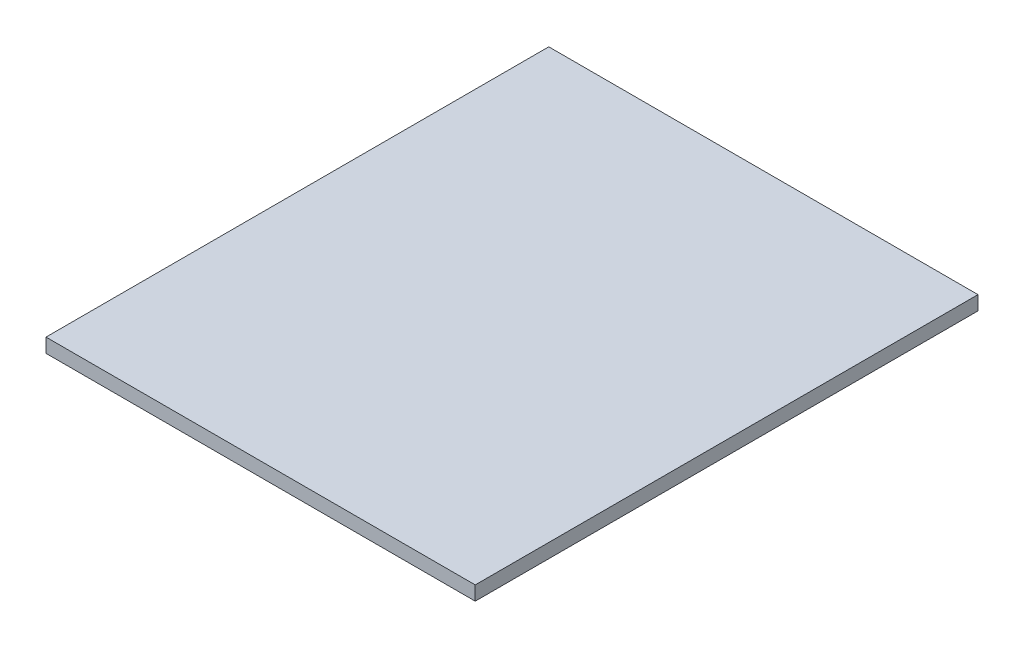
ISO-10303-21;
HEADER;
FILE_DESCRIPTION(('STEP AP214'),'2;1');
FILE_NAME('part.step','',(''),(''),'','','');
FILE_SCHEMA(('AUTOMOTIVE_DESIGN { 1 0 10303 214 1 1 1 1 }'));
ENDSEC;
DATA;
#1=APPLICATION_CONTEXT('core data for automotive mechanical design processes');
#2=APPLICATION_PROTOCOL_DEFINITION('international standard','automotive_design',2000,#1);
#3=PRODUCT_CONTEXT('',#1,'mechanical');
#4=PRODUCT('Part','Part','',(#3));
#5=PRODUCT_RELATED_PRODUCT_CATEGORY('part','',(#4));
#6=PRODUCT_DEFINITION_FORMATION('','',#4);
#7=PRODUCT_DEFINITION_CONTEXT('part definition',#1,'design');
#8=PRODUCT_DEFINITION('design','',#6,#7);
#9=PRODUCT_DEFINITION_SHAPE('','',#8);
#10=(LENGTH_UNIT() NAMED_UNIT(*) SI_UNIT(.MILLI.,.METRE.));
#11=(NAMED_UNIT(*) PLANE_ANGLE_UNIT() SI_UNIT($,.RADIAN.));
#12=(NAMED_UNIT(*) SI_UNIT($,.STERADIAN.) SOLID_ANGLE_UNIT());
#13=UNCERTAINTY_MEASURE_WITH_UNIT(LENGTH_MEASURE(1.E-05),#10,'distance_accuracy_value','');
#14=(GEOMETRIC_REPRESENTATION_CONTEXT(3) GLOBAL_UNCERTAINTY_ASSIGNED_CONTEXT((#13)) GLOBAL_UNIT_ASSIGNED_CONTEXT((#10,
#11,#12)) REPRESENTATION_CONTEXT('',''));
#15=CARTESIAN_POINT('',(0.,0.,0.));
#16=DIRECTION('',(0.,0.,1.));
#17=DIRECTION('',(1.,0.,0.));
#18=AXIS2_PLACEMENT_3D('',#15,#16,#17);
#19=CARTESIAN_POINT('',(9.4933098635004,2.5,-60.));
#20=DIRECTION('',(-1.,0.,0.));
#21=DIRECTION('',(0.,0.,1.));
#22=AXIS2_PLACEMENT_3D('',#19,#20,#21);
#23=PLANE('',#22);
#24=DIRECTION('',(0.,0.,-1.));
#25=VECTOR('',#24,1.);
#26=CARTESIAN_POINT('',(9.4933098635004,0.,-60.));
#27=LINE('',#26,#25);
#28=CARTESIAN_POINT('',(9.49330986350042,0.,29.02));
#29=VERTEX_POINT('',#28);
#30=CARTESIAN_POINT('',(9.4933098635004,0.,-60.));
#31=VERTEX_POINT('',#30);
#32=EDGE_CURVE('E98',#29,#31,#27,.T.);
#33=ORIENTED_EDGE('',*,*,#32,.T.);
#34=DIRECTION('',(0.,-1.,0.));
#35=VECTOR('',#34,1.);
#36=CARTESIAN_POINT('',(9.4933098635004,2.5,-60.));
#37=LINE('',#36,#35);
#38=CARTESIAN_POINT('',(9.4933098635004,2.5,-60.));
#39=VERTEX_POINT('',#38);
#40=EDGE_CURVE('E11',#39,#31,#37,.T.);
#41=ORIENTED_EDGE('',*,*,#40,.F.);
#42=DIRECTION('',(0.,0.,-1.));
#43=VECTOR('',#42,1.);
#44=CARTESIAN_POINT('',(9.4933098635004,2.5,-60.));
#45=LINE('',#44,#43);
#46=CARTESIAN_POINT('',(9.49330986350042,2.5,29.02));
#47=VERTEX_POINT('',#46);
#48=EDGE_CURVE('E86',#47,#39,#45,.T.);
#49=ORIENTED_EDGE('',*,*,#48,.F.);
#50=DIRECTION('',(0.,-1.,0.));
#51=VECTOR('',#50,1.);
#52=CARTESIAN_POINT('',(9.49330986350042,2.5,29.02));
#53=LINE('',#52,#51);
#54=EDGE_CURVE('E94',#47,#29,#53,.T.);
#55=ORIENTED_EDGE('',*,*,#54,.T.);
#56=EDGE_LOOP('',(#33,#41,#49,#55));
#57=FACE_BOUND('',#56,.T.);
#58=ADVANCED_FACE('F35',(#57),#23,.F.);
#59=CARTESIAN_POINT('',(-66.5066901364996,2.5,-60.));
#60=DIRECTION('',(0.,0.,1.));
#61=DIRECTION('',(1.,0.,0.));
#62=AXIS2_PLACEMENT_3D('',#59,#60,#61);
#63=PLANE('',#62);
#64=DIRECTION('',(-1.,0.,0.));
#65=VECTOR('',#64,1.);
#66=CARTESIAN_POINT('',(-66.5066901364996,0.,-60.));
#67=LINE('',#66,#65);
#68=CARTESIAN_POINT('',(-66.5066901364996,0.,-60.));
#69=VERTEX_POINT('',#68);
#70=EDGE_CURVE('E90',#31,#69,#67,.T.);
#71=ORIENTED_EDGE('',*,*,#70,.T.);
#72=DIRECTION('',(0.,-1.,0.));
#73=VECTOR('',#72,1.);
#74=CARTESIAN_POINT('',(-66.5066901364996,2.5,-60.));
#75=LINE('',#74,#73);
#76=CARTESIAN_POINT('',(-66.5066901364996,2.5,-60.));
#77=VERTEX_POINT('',#76);
#78=EDGE_CURVE('E43',#77,#69,#75,.T.);
#79=ORIENTED_EDGE('',*,*,#78,.F.);
#80=DIRECTION('',(-1.,0.,0.));
#81=VECTOR('',#80,1.);
#82=CARTESIAN_POINT('',(-66.5066901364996,2.5,-60.));
#83=LINE('',#82,#81);
#84=EDGE_CURVE('E81',#39,#77,#83,.T.);
#85=ORIENTED_EDGE('',*,*,#84,.F.);
#86=ORIENTED_EDGE('',*,*,#40,.T.);
#87=EDGE_LOOP('',(#71,#79,#85,#86));
#88=FACE_BOUND('',#87,.T.);
#89=ADVANCED_FACE('F89',(#88),#63,.F.);
#90=CARTESIAN_POINT('',(-66.5066901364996,2.5,-60.));
#91=DIRECTION('',(1.,0.,0.));
#92=DIRECTION('',(0.,0.,-1.));
#93=AXIS2_PLACEMENT_3D('',#90,#91,#92);
#94=PLANE('',#93);
#95=DIRECTION('',(0.,0.,1.));
#96=VECTOR('',#95,1.);
#97=CARTESIAN_POINT('',(-66.5066901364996,0.,-60.));
#98=LINE('',#97,#96);
#99=CARTESIAN_POINT('',(-66.5066901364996,0.,29.02));
#100=VERTEX_POINT('',#99);
#101=EDGE_CURVE('E68',#69,#100,#98,.T.);
#102=ORIENTED_EDGE('',*,*,#101,.T.);
#103=DIRECTION('',(0.,-1.,0.));
#104=VECTOR('',#103,1.);
#105=CARTESIAN_POINT('',(-66.5066901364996,2.5,29.02));
#106=LINE('',#105,#104);
#107=CARTESIAN_POINT('',(-66.5066901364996,2.5,29.02));
#108=VERTEX_POINT('',#107);
#109=EDGE_CURVE('E91',#108,#100,#106,.T.);
#110=ORIENTED_EDGE('',*,*,#109,.F.);
#111=DIRECTION('',(0.,0.,1.));
#112=VECTOR('',#111,1.);
#113=CARTESIAN_POINT('',(-66.5066901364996,2.5,-60.));
#114=LINE('',#113,#112);
#115=EDGE_CURVE('E84',#77,#108,#114,.T.);
#116=ORIENTED_EDGE('',*,*,#115,.F.);
#117=ORIENTED_EDGE('',*,*,#78,.T.);
#118=EDGE_LOOP('',(#102,#110,#116,#117));
#119=FACE_BOUND('',#118,.T.);
#120=ADVANCED_FACE('F92',(#119),#94,.F.);
#121=CARTESIAN_POINT('',(-66.5066901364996,2.5,29.02));
#122=DIRECTION('',(0.,0.,-1.));
#123=DIRECTION('',(-1.,0.,0.));
#124=AXIS2_PLACEMENT_3D('',#121,#122,#123);
#125=PLANE('',#124);
#126=DIRECTION('',(1.,0.,0.));
#127=VECTOR('',#126,1.);
#128=CARTESIAN_POINT('',(-66.5066901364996,0.,29.02));
#129=LINE('',#128,#127);
#130=EDGE_CURVE('E74',#100,#29,#129,.T.);
#131=ORIENTED_EDGE('',*,*,#130,.T.);
#132=ORIENTED_EDGE('',*,*,#54,.F.);
#133=DIRECTION('',(1.,0.,0.));
#134=VECTOR('',#133,1.);
#135=CARTESIAN_POINT('',(-66.5066901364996,2.5,29.02));
#136=LINE('',#135,#134);
#137=EDGE_CURVE('E51',#108,#47,#136,.T.);
#138=ORIENTED_EDGE('',*,*,#137,.F.);
#139=ORIENTED_EDGE('',*,*,#109,.T.);
#140=EDGE_LOOP('',(#131,#132,#138,#139));
#141=FACE_BOUND('',#140,.T.);
#142=ADVANCED_FACE('F105',(#141),#125,.F.);
#143=CARTESIAN_POINT('',(0.,2.5,0.));
#144=DIRECTION('',(0.,1.,0.));
#145=DIRECTION('',(0.,0.,1.));
#146=AXIS2_PLACEMENT_3D('',#143,#144,#145);
#147=PLANE('',#146);
#148=ORIENTED_EDGE('',*,*,#48,.T.);
#149=ORIENTED_EDGE('',*,*,#84,.T.);
#150=ORIENTED_EDGE('',*,*,#115,.T.);
#151=ORIENTED_EDGE('',*,*,#137,.T.);
#152=EDGE_LOOP('',(#148,#149,#150,#151));
#153=FACE_BOUND('',#152,.T.);
#154=ADVANCED_FACE('F82',(#153),#147,.T.);
#155=CARTESIAN_POINT('',(0.,0.,0.));
#156=DIRECTION('',(0.,1.,0.));
#157=DIRECTION('',(0.,0.,1.));
#158=AXIS2_PLACEMENT_3D('',#155,#156,#157);
#159=PLANE('',#158);
#160=ORIENTED_EDGE('',*,*,#32,.F.);
#161=ORIENTED_EDGE('',*,*,#130,.F.);
#162=ORIENTED_EDGE('',*,*,#101,.F.);
#163=ORIENTED_EDGE('',*,*,#70,.F.);
#164=EDGE_LOOP('',(#160,#161,#162,#163));
#165=FACE_BOUND('',#164,.T.);
#166=ADVANCED_FACE('F108',(#165),#159,.F.);
#167=CLOSED_SHELL('',(#58,#89,#120,#142,#154,#166));
#168=MANIFOLD_SOLID_BREP('B2',#167);
#169=ADVANCED_BREP_SHAPE_REPRESENTATION('',(#18,#168),#14);
#170=SHAPE_DEFINITION_REPRESENTATION(#9,#169);
ENDSEC;
END-ISO-10303-21;
